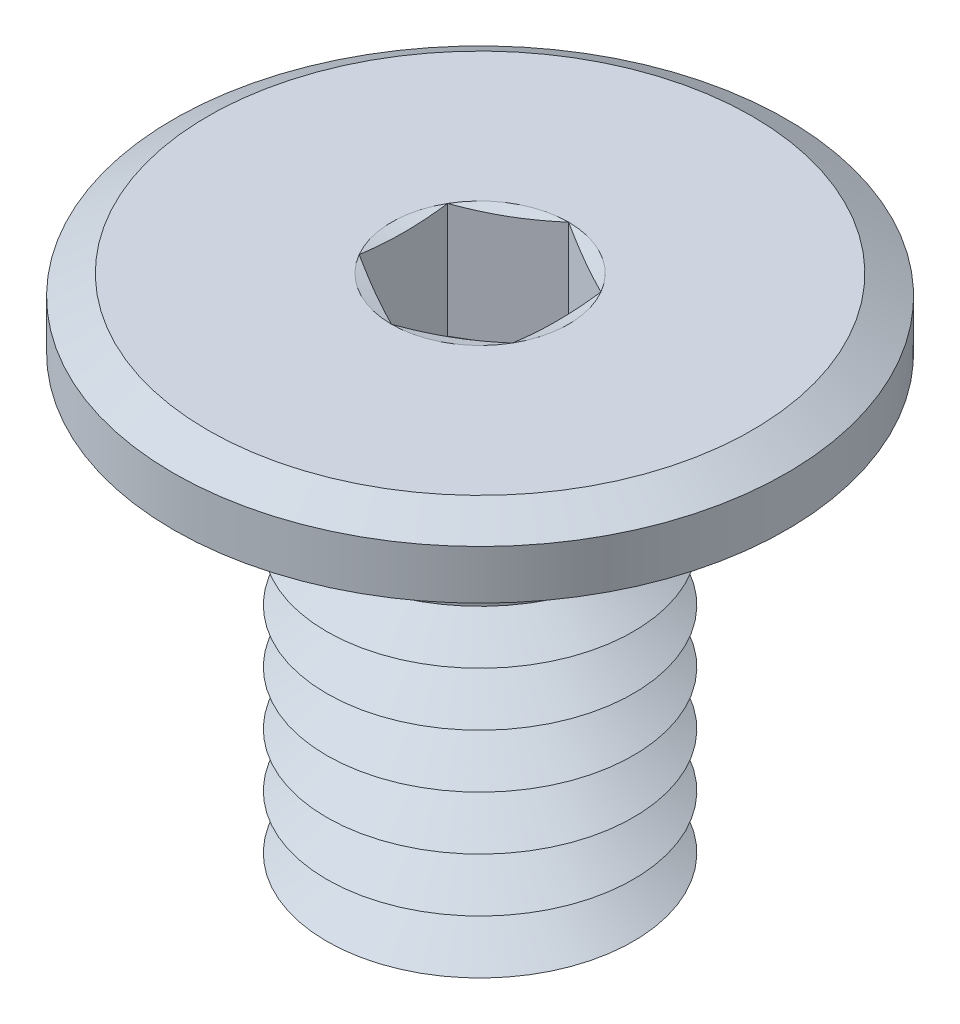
from build123d import *

# Parameters (mm, degrees)
SKETCH1_R           = 4
BOSS_EXTRUDE1_DEPTH = 0.9
SKETCH2_R           = 2
BOSS_EXTRUDE2_DEPTH = 6
LPATTERN1_COUNT     = 7
LPATTERN1_PITCH     = 0.7
FILLET1_R           = 0.2
CHAMFER2_SIZE       = 0.45
CHAMFER2_SIZE2      = 0.259807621
CUT_EXTRUDE1_DEPTH  = 1.5


with BuildPart() as part:
    # Sketch1 → Boss-Extrude1 (new body)
    with BuildSketch(Plane(origin=(0, 0, 0), x_dir=(1, 0, 0), z_dir=(0, 1, 0))):
        with Locations(Location((0, 0, 0), (0, 0, 270))):
            Circle(SKETCH1_R)
    extrude(amount=-BOSS_EXTRUDE1_DEPTH)

    # Sketch2 → Boss-Extrude2 (add)
    with BuildSketch(Plane.XZ.offset(0.9)):
        with Locations(Location((0, 0, 0), (0, 0, 270))):
            Circle(SKETCH2_R)
    extrude(amount=BOSS_EXTRUDE2_DEPTH)

    # Sketch5 → Cut-Revolve1 (revolve, cut)
    with BuildSketch(Plane(origin=(0, 0, 0), x_dir=(0, 0, -1), z_dir=(1, 0, 0))):
        Polygon((-2, -7.25), (-1.393782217, -6.9), (-2, -6.55), align=None)
    cut_revolve1 = revolve(axis=Axis((0, 0.990593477, 0), (0, -1, 0)), mode=Mode.SUBTRACT)

    # LPattern1: Cut-Revolve1 ×7
    with Locations(*[(0, i * LPATTERN1_PITCH, 0) for i in range(1, LPATTERN1_COUNT)]):
        add(cut_revolve1, mode=Mode.SUBTRACT)

    # Fillet1
    fillet1_edges = [part.edges().sort_by_distance(p)[0] for p in [
        (0, -0.9, 2),
    ]]
    fillet(fillet1_edges, radius=FILLET1_R)

    # Chamfer2
    chamfer2_edges = [part.edges().sort_by_distance(p)[0] for p in [
        (0, 0, -4),
    ]]
    chamfer2_side = [part.faces().sort_by_distance(p)[0] for p in [
        (0, 0, 0),
    ]]
    chamfer(chamfer2_edges, length=CHAMFER2_SIZE, length2=CHAMFER2_SIZE2, reference=chamfer2_side[0])

    # Sketch6 → Cut-Extrude1 (cut)
    with BuildSketch(Plane(origin=(0, 0, 0), x_dir=(1, 0, 0), z_dir=(0, 1, 0))):
        Polygon((0, 1.154700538), (-1, 0.577350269), (-1, -0.577350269), (0, -1.154700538), (1, -0.577350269), (1, 0.577350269), align=None)
    extrude(amount=-CUT_EXTRUDE1_DEPTH, mode=Mode.SUBTRACT)

    # Cut-Extrude2 cone 1 section (on through the dimple's axis) → Cut-Extrude2 (revolve, cut)
    with BuildSketch(Plane(origin=(0, -1.5, 0), x_dir=(0, 0, 1), z_dir=(1, 0, 0))):
        Polygon((0, 0), (1, 0), (0, 0.577350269), align=None)
    revolve(axis=Axis((0, -1.5, 0), (0, -1, 0)), mode=Mode.SUBTRACT)

    # Cut-Extrude3 cone 1 section (on through the dimple's axis) → Cut-Extrude3 (revolve, cut)
    with BuildSketch(Plane(origin=(0, 0, 0), x_dir=(0, 0, 1), z_dir=(1, 0, 0))):
        Polygon((0, 0), (1.154700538, 0), (0, 0.309401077), align=None)
    revolve(axis=Axis((0, 0, 0), (0, -1, 0)), mode=Mode.SUBTRACT)


solid = part.part
